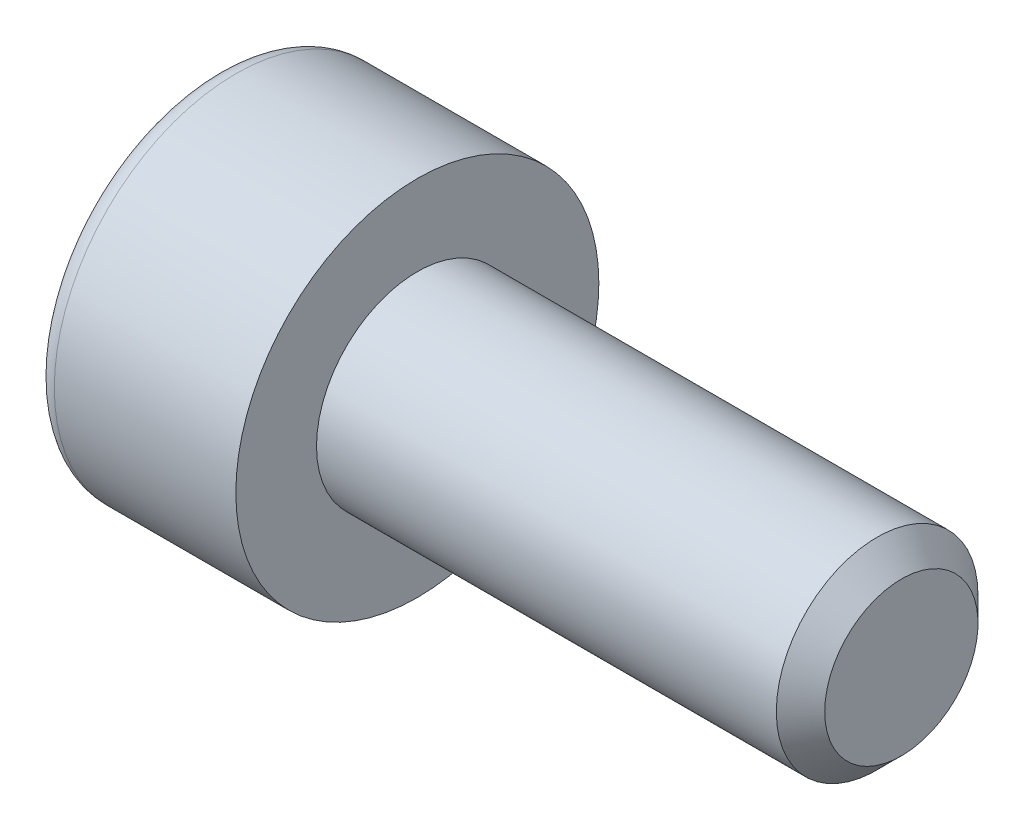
ISO-10303-21;
HEADER;
FILE_DESCRIPTION(('STEP AP214'),'2;1');
FILE_NAME('part.step','',(''),(''),'','','');
FILE_SCHEMA(('AUTOMOTIVE_DESIGN { 1 0 10303 214 1 1 1 1 }'));
ENDSEC;
DATA;
#1=APPLICATION_CONTEXT('core data for automotive mechanical design processes');
#2=APPLICATION_PROTOCOL_DEFINITION('international standard','automotive_design',2000,#1);
#3=PRODUCT_CONTEXT('',#1,'mechanical');
#4=PRODUCT('Part','Part','',(#3));
#5=PRODUCT_RELATED_PRODUCT_CATEGORY('part','',(#4));
#6=PRODUCT_DEFINITION_FORMATION('','',#4);
#7=PRODUCT_DEFINITION_CONTEXT('part definition',#1,'design');
#8=PRODUCT_DEFINITION('design','',#6,#7);
#9=PRODUCT_DEFINITION_SHAPE('','',#8);
#10=(LENGTH_UNIT() NAMED_UNIT(*) SI_UNIT(.MILLI.,.METRE.));
#11=(NAMED_UNIT(*) PLANE_ANGLE_UNIT() SI_UNIT($,.RADIAN.));
#12=(NAMED_UNIT(*) SI_UNIT($,.STERADIAN.) SOLID_ANGLE_UNIT());
#13=UNCERTAINTY_MEASURE_WITH_UNIT(LENGTH_MEASURE(1.E-05),#10,'distance_accuracy_value','');
#14=(GEOMETRIC_REPRESENTATION_CONTEXT(3) GLOBAL_UNCERTAINTY_ASSIGNED_CONTEXT((#13)) GLOBAL_UNIT_ASSIGNED_CONTEXT((#10,
#11,#12)) REPRESENTATION_CONTEXT('',''));
#15=CARTESIAN_POINT('',(0.,0.,0.));
#16=DIRECTION('',(0.,0.,1.));
#17=DIRECTION('',(1.,0.,0.));
#18=AXIS2_PLACEMENT_3D('',#15,#16,#17);
#19=CARTESIAN_POINT('',(-0.849999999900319,0.,0.));
#20=DIRECTION('',(-1.,0.,0.));
#21=DIRECTION('',(0.,-1.00000000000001,0.));
#22=AXIS2_PLACEMENT_3D('',#19,#20,#21);
#23=CONICAL_SURFACE('',#22,0.952380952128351,1.04719755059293);
#24=CARTESIAN_POINT('',(-0.300142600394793,-3.97903932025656E-10,0.));
#25=VERTEX_POINT('',#24);
#26=VERTEX_LOOP('',#25);
#27=FACE_BOUND('',#26,.T.);
#28=CARTESIAN_POINT('',(-0.850000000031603,0.,0.));
#29=DIRECTION('',(-1.,0.,0.));
#30=DIRECTION('',(0.,-1.00000000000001,0.));
#31=AXIS2_PLACEMENT_3D('',#28,#29,#30);
#32=CIRCLE('',#31,0.952380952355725);
#33=CARTESIAN_POINT('',(-0.850000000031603,-0.952380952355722,0.));
#34=VERTEX_POINT('',#33);
#35=EDGE_CURVE('E362',#34,#34,#32,.T.);
#36=ORIENTED_EDGE('',*,*,#35,.T.);
#37=EDGE_LOOP('',(#36));
#38=FACE_BOUND('',#37,.T.);
#39=ADVANCED_FACE('F17',(#27,#38),#23,.F.);
#40=CARTESIAN_POINT('',(-0.850000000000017,0.574463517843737,0.995000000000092));
#41=DIRECTION('',(0.,0.,1.00000000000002));
#42=DIRECTION('',(1.,0.,0.));
#43=AXIS2_PLACEMENT_3D('',#40,#41,#42);
#44=PLANE('',#43);
#45=DIRECTION('',(1.,0.,0.));
#46=VECTOR('',#45,1.);
#47=CARTESIAN_POINT('',(-0.850000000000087,-0.574463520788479,0.994999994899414));
#48=LINE('',#47,#46);
#49=CARTESIAN_POINT('',(-0.850000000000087,-0.57446352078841,0.994999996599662));
#50=VERTEX_POINT('',#49);
#51=CARTESIAN_POINT('',(-2.49892704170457,-0.574463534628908,0.994999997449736));
#52=VERTEX_POINT('',#51);
#53=EDGE_CURVE('E276',#50,#52,#48,.F.);
#54=ORIENTED_EDGE('',*,*,#53,.T.);
#55=CARTESIAN_POINT('',(-2.34499999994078,0.,0.995000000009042));
#56=CARTESIAN_POINT('',(-2.34497439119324,-0.0305677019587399,0.995000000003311));
#57=CARTESIAN_POINT('',(-2.34640800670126,-0.0611198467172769,0.995000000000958));
#58=CARTESIAN_POINT('',(-2.3519924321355,-0.121922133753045,0.994999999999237));
#59=CARTESIAN_POINT('',(-2.35613836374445,-0.152172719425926,0.994999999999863));
#60=CARTESIAN_POINT('',(-2.36686597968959,-0.21175945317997,0.995000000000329));
#61=CARTESIAN_POINT('',(-2.37340998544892,-0.241102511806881,0.99500000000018));
#62=CARTESIAN_POINT('',(-2.38864217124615,-0.299229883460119,0.995000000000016));
#63=CARTESIAN_POINT('',(-2.3973310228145,-0.328014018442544,0.995000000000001));
#64=CARTESIAN_POINT('',(-2.41947932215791,-0.393688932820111,0.995000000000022));
#65=CARTESIAN_POINT('',(-2.43358464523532,-0.430359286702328,0.995000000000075));
#66=CARTESIAN_POINT('',(-2.46443795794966,-0.503023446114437,0.995000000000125));
#67=CARTESIAN_POINT('',(-2.48121157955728,-0.53900644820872,0.99500000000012));
#68=CARTESIAN_POINT('',(-2.49892704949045,-0.574463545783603,0.995000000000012));
#69=B_SPLINE_CURVE_WITH_KNOTS('',3,(#55,#56,#57,#58,#59,#60,#61,#62,#63,#64,#65,#66,#67,#68),
.UNSPECIFIED.,.F.,.F.,(4,2,2,2,2,2,4),(0.,0.0916446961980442,0.1831250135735,0.273225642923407,
0.363354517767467,0.481117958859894,0.600089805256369),.UNSPECIFIED.);
#70=CARTESIAN_POINT('',(-2.34499999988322,0.,0.995000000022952));
#71=VERTEX_POINT('',#70);
#72=EDGE_CURVE('E95',#71,#52,#69,.T.);
#73=ORIENTED_EDGE('',*,*,#72,.F.);
#74=CARTESIAN_POINT('',(-2.4989270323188,0.574463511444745,0.995000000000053));
#75=CARTESIAN_POINT('',(-2.47907510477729,0.534722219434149,0.995000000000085));
#76=CARTESIAN_POINT('',(-2.4603959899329,0.494309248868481,0.995000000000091));
#77=CARTESIAN_POINT('',(-2.42621425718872,0.411872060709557,0.995000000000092));
#78=CARTESIAN_POINT('',(-2.41073261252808,0.36983922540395,0.995000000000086));
#79=CARTESIAN_POINT('',(-2.38444123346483,0.285641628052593,0.9950000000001));
#80=CARTESIAN_POINT('',(-2.37350879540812,0.243516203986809,0.995000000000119));
#81=CARTESIAN_POINT('',(-2.35666503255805,0.158361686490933,0.995000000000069));
#82=CARTESIAN_POINT('',(-2.35073836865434,0.115335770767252,0.995));
#83=CARTESIAN_POINT('',(-2.34674431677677,0.0601561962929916,0.995000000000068));
#84=CARTESIAN_POINT('',(-2.3460924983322,0.0481633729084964,0.995000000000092));
#85=CARTESIAN_POINT('',(-2.34521965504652,0.0241145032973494,0.995000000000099));
#86=CARTESIAN_POINT('',(-2.34500034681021,0.0120583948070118,0.995000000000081));
#87=CARTESIAN_POINT('',(-2.34499999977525,1.11022302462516E-13,0.995000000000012));
#88=B_SPLINE_CURVE_WITH_KNOTS('',3,(#74,#75,#76,#77,#78,#79,#80,#81,#82,#83,#84,#85,#86,#87),
.UNSPECIFIED.,.F.,.F.,(4,2,2,2,2,2,4),(0.,0.133369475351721,0.267587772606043,0.397905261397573,
0.527821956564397,0.563847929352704,0.600016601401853),.UNSPECIFIED.);
#89=CARTESIAN_POINT('',(-2.4989270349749,0.57446351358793,0.995000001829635));
#90=VERTEX_POINT('',#89);
#91=EDGE_CURVE('E89',#90,#71,#88,.T.);
#92=ORIENTED_EDGE('',*,*,#91,.F.);
#93=DIRECTION('',(1.,0.,0.));
#94=VECTOR('',#93,1.);
#95=CARTESIAN_POINT('',(-0.850000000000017,0.574463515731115,0.995000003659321));
#96=LINE('',#95,#94);
#97=CARTESIAN_POINT('',(-0.850000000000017,0.574463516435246,0.99500000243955));
#98=VERTEX_POINT('',#97);
#99=EDGE_CURVE('E93',#90,#98,#96,.T.);
#100=ORIENTED_EDGE('',*,*,#99,.T.);
#101=DIRECTION('',(0.,1.00000000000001,0.));
#102=VECTOR('',#101,1.);
#103=CARTESIAN_POINT('',(-0.850000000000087,0.,0.994999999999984));
#104=LINE('',#103,#102);
#105=EDGE_CURVE('E107',#98,#50,#104,.F.);
#106=ORIENTED_EDGE('',*,*,#105,.T.);
#107=EDGE_LOOP('',(#54,#73,#92,#100,#106));
#108=FACE_BOUND('',#107,.T.);
#109=ADVANCED_FACE('F92',(#108),#44,.F.);
#110=CARTESIAN_POINT('',(-0.850000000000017,0.,0.));
#111=DIRECTION('',(1.,0.,0.));
#112=DIRECTION('',(0.,0.,-1.00000000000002));
#113=AXIS2_PLACEMENT_3D('',#110,#111,#112);
#114=PLANE('',#113);
#115=DIRECTION('',(0.,1.00000000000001,0.));
#116=VECTOR('',#115,1.);
#117=CARTESIAN_POINT('',(-0.850000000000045,-0.574463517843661,-0.995000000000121));
#118=LINE('',#117,#116);
#119=CARTESIAN_POINT('',(-0.850000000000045,0.574463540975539,-0.994999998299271));
#120=VERTEX_POINT('',#119);
#121=CARTESIAN_POINT('',(-0.850000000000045,-0.574463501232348,-0.995000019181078));
#122=VERTEX_POINT('',#121);
#123=EDGE_CURVE('E266',#120,#122,#118,.F.);
#124=ORIENTED_EDGE('',*,*,#123,.T.);
#125=DIRECTION('',(0.,0.499999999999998,-0.866025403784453));
#126=VECTOR('',#125,1.);
#127=CARTESIAN_POINT('',(-0.850000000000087,-1.14892703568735,0.));
#128=LINE('',#127,#126);
#129=CARTESIAN_POINT('',(-0.850000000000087,-1.14892703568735,0.));
#130=VERTEX_POINT('',#129);
#131=EDGE_CURVE('E115',#122,#130,#128,.F.);
#132=ORIENTED_EDGE('',*,*,#131,.T.);
#133=DIRECTION('',(0.,-0.500000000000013,-0.866025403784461));
#134=VECTOR('',#133,1.);
#135=CARTESIAN_POINT('',(-0.850000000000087,-0.574463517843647,0.995000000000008));
#136=LINE('',#135,#134);
#137=EDGE_CURVE('E368',#130,#50,#136,.F.);
#138=ORIENTED_EDGE('',*,*,#137,.T.);
#139=ORIENTED_EDGE('',*,*,#105,.F.);
#140=DIRECTION('',(0.,-0.499999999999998,0.866025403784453));
#141=VECTOR('',#140,1.);
#142=CARTESIAN_POINT('',(-0.850000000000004,1.14892703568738,0.));
#143=LINE('',#142,#141);
#144=CARTESIAN_POINT('',(-0.850000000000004,1.14892703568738,0.));
#145=VERTEX_POINT('',#144);
#146=EDGE_CURVE('E106',#98,#145,#143,.F.);
#147=ORIENTED_EDGE('',*,*,#146,.T.);
#148=DIRECTION('',(0.,0.500000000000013,0.866025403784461));
#149=VECTOR('',#148,1.);
#150=CARTESIAN_POINT('',(-0.850000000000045,0.574463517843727,-0.995000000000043));
#151=LINE('',#150,#149);
#152=EDGE_CURVE('E268',#145,#120,#151,.F.);
#153=ORIENTED_EDGE('',*,*,#152,.T.);
#154=EDGE_LOOP('',(#124,#132,#138,#139,#147,#153));
#155=FACE_BOUND('',#154,.T.);
#156=ORIENTED_EDGE('',*,*,#35,.F.);
#157=EDGE_LOOP('',(#156));
#158=FACE_BOUND('',#157,.T.);
#159=ADVANCED_FACE('F165',(#155,#158),#114,.F.);
#160=CARTESIAN_POINT('',(-0.850000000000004,1.14892703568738,0.));
#161=DIRECTION('',(0.,0.866025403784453,0.500000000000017));
#162=DIRECTION('',(0.,-0.499999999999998,0.866025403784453));
#163=AXIS2_PLACEMENT_3D('',#160,#161,#162);
#164=PLANE('',#163);
#165=ORIENTED_EDGE('',*,*,#99,.F.);
#166=CARTESIAN_POINT('',(-2.49892703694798,0.574463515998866,0.995000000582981));
#167=CARTESIAN_POINT('',(-2.47920127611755,0.594208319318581,0.960800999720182));
#168=CARTESIAN_POINT('',(-2.46063414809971,0.614283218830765,0.926030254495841));
#169=CARTESIAN_POINT('',(-2.42663856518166,0.655218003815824,0.855129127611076));
#170=CARTESIAN_POINT('',(-2.41122901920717,0.676081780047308,0.818992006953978));
#171=CARTESIAN_POINT('',(-2.3848328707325,0.718152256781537,0.746123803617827));
#172=CARTESIAN_POINT('',(-2.37377985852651,0.739348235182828,0.709411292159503));
#173=CARTESIAN_POINT('',(-2.35674986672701,0.782206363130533,0.635178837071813));
#174=CARTESIAN_POINT('',(-2.35076018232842,0.803867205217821,0.59766115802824));
#175=CARTESIAN_POINT('',(-2.34535763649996,0.841202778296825,0.532994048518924));
#176=CARTESIAN_POINT('',(-2.34455932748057,0.856829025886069,0.50592859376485));
#177=CARTESIAN_POINT('',(-2.34590474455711,0.888051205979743,0.451850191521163));
#178=CARTESIAN_POINT('',(-2.34804912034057,0.903647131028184,0.424837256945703));
#179=CARTESIAN_POINT('',(-2.35875462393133,0.950212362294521,0.344183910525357));
#180=CARTESIAN_POINT('',(-2.37158937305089,0.980949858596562,0.290945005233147));
#181=CARTESIAN_POINT('',(-2.40257138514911,1.03491361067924,0.197477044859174));
#182=CARTESIAN_POINT('',(-2.41909924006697,1.0583922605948,0.15681083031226));
#183=CARTESIAN_POINT('',(-2.45633127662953,1.10442922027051,0.0770724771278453));
#184=CARTESIAN_POINT('',(-2.47702183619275,1.12699025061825,0.0379956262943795));
#185=CARTESIAN_POINT('',(-2.49914390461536,1.14914384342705,-0.000375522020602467));
#186=B_SPLINE_CURVE_WITH_KNOTS('',3,(#166,#167,#168,#169,#170,#171,#172,#173,#174,#175,#176,
#177,#178,#179,#180,#181,#182,#183,#184,#185),.UNSPECIFIED.,.F.,.F.,(4,2,2,2,2,2,2,2,2,4),(0.,
0.132518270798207,0.265808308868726,0.396979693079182,0.527820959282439,0.621473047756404,
0.715145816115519,0.902546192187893,1.05168981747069,1.20035309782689),.UNSPECIFIED.);
#187=CARTESIAN_POINT('',(-2.49966772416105,1.14925824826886,-7.03980238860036E-06));
#188=VERTEX_POINT('',#187);
#189=EDGE_CURVE('E104',#90,#188,#186,.T.);
#190=ORIENTED_EDGE('',*,*,#189,.T.);
#191=DIRECTION('',(1.,0.,0.));
#192=VECTOR('',#191,1.);
#193=CARTESIAN_POINT('',(-0.850000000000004,1.14892703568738,0.));
#194=LINE('',#193,#192);
#195=EDGE_CURVE('E367',#188,#145,#194,.T.);
#196=ORIENTED_EDGE('',*,*,#195,.T.);
#197=ORIENTED_EDGE('',*,*,#146,.F.);
#198=EDGE_LOOP('',(#165,#190,#196,#197));
#199=FACE_BOUND('',#198,.T.);
#200=ADVANCED_FACE('F102',(#199),#164,.F.);
#201=CARTESIAN_POINT('',(-0.850000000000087,-0.574463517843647,0.995000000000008));
#202=DIRECTION('',(0.,-0.866025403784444,0.500000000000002));
#203=DIRECTION('',(0.,-0.500000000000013,-0.866025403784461));
#204=AXIS2_PLACEMENT_3D('',#201,#202,#203);
#205=PLANE('',#204);
#206=DIRECTION('',(-1.,0.,0.));
#207=VECTOR('',#206,1.);
#208=CARTESIAN_POINT('',(-0.850000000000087,-1.14892703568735,0.));
#209=LINE('',#208,#207);
#210=CARTESIAN_POINT('',(-2.49966773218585,-1.14925825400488,-7.06998226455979E-06));
#211=VERTEX_POINT('',#210);
#212=EDGE_CURVE('E138',#130,#211,#209,.T.);
#213=ORIENTED_EDGE('',*,*,#212,.T.);
#214=CARTESIAN_POINT('',(-2.49914391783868,-1.14914385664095,-0.000375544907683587));
#215=CARTESIAN_POINT('',(-2.47939437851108,-1.12938634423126,0.0338454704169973));
#216=CARTESIAN_POINT('',(-2.46080382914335,-1.10929839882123,0.0686388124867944));
#217=CARTESIAN_POINT('',(-2.42676345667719,-1.06833625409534,0.139587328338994));
#218=CARTESIAN_POINT('',(-2.4113325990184,-1.04745814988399,0.175749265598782));
#219=CARTESIAN_POINT('',(-2.38489828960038,-1.00535786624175,0.248669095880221));
#220=CARTESIAN_POINT('',(-2.37382839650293,-0.984146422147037,0.28540839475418));
#221=CARTESIAN_POINT('',(-2.35677144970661,-0.941256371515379,0.359696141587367));
#222=CARTESIAN_POINT('',(-2.35077164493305,-0.919579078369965,0.397242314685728));
#223=CARTESIAN_POINT('',(-2.34536074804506,-0.88222607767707,0.461939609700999));
#224=CARTESIAN_POINT('',(-2.3445600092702,-0.866599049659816,0.489006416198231));
#225=CARTESIAN_POINT('',(-2.34590089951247,-0.835375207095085,0.543087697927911));
#226=CARTESIAN_POINT('',(-2.34804317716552,-0.819778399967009,0.570102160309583));
#227=CARTESIAN_POINT('',(-2.35874295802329,-0.773210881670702,0.650759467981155));
#228=CARTESIAN_POINT('',(-2.37157459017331,-0.74247185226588,0.704001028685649));
#229=CARTESIAN_POINT('',(-2.40253243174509,-0.688540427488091,0.797412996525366));
#230=CARTESIAN_POINT('',(-2.4190307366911,-0.665094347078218,0.838022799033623));
#231=CARTESIAN_POINT('',(-2.45619424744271,-0.619119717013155,0.917653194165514));
#232=CARTESIAN_POINT('',(-2.47684592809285,-0.596588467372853,0.956678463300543));
#233=CARTESIAN_POINT('',(-2.49892698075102,-0.574463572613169,0.994999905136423));
#234=B_SPLINE_CURVE_WITH_KNOTS('',3,(#214,#215,#216,#217,#218,#219,#220,#221,#222,#223,#224,
#225,#226,#227,#228,#229,#230,#231,#232,#233),.UNSPECIFIED.,.F.,.F.,(4,2,2,2,2,2,2,2,2,4),(0.,
0.132618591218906,0.266011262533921,0.397284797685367,0.528227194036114,0.621884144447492,
0.715561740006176,0.902968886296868,1.05189958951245,1.20035294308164),.UNSPECIFIED.);
#235=EDGE_CURVE('E117',#211,#52,#234,.T.);
#236=ORIENTED_EDGE('',*,*,#235,.T.);
#237=ORIENTED_EDGE('',*,*,#53,.F.);
#238=ORIENTED_EDGE('',*,*,#137,.F.);
#239=EDGE_LOOP('',(#213,#236,#237,#238));
#240=FACE_BOUND('',#239,.T.);
#241=ADVANCED_FACE('F174',(#240),#205,.F.);
#242=CARTESIAN_POINT('',(-0.850000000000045,0.574463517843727,-0.995000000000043));
#243=DIRECTION('',(0.,0.866025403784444,-0.500000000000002));
#244=DIRECTION('',(0.,0.500000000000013,0.866025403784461));
#245=AXIS2_PLACEMENT_3D('',#242,#243,#244);
#246=PLANE('',#245);
#247=ORIENTED_EDGE('',*,*,#195,.F.);
#248=CARTESIAN_POINT('',(-2.49913902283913,1.1491389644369,0.000367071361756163));
#249=CARTESIAN_POINT('',(-2.47939002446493,1.12938174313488,-0.0338534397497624));
#250=CARTESIAN_POINT('',(-2.46080000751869,1.10929409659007,-0.0686462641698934));
#251=CARTESIAN_POINT('',(-2.42676065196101,1.0683325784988,-0.139593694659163));
#252=CARTESIAN_POINT('',(-2.41133027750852,1.04745480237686,-0.1757550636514));
#253=CARTESIAN_POINT('',(-2.38489682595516,1.00535519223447,-0.24867372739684));
#254=CARTESIAN_POINT('',(-2.37382730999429,0.984144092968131,-0.285412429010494));
#255=CARTESIAN_POINT('',(-2.35677096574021,0.941254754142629,-0.359698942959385));
#256=CARTESIAN_POINT('',(-2.35077138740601,0.919577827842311,-0.397244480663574));
#257=CARTESIAN_POINT('',(-2.34536067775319,0.882225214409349,-0.461941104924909));
#258=CARTESIAN_POINT('',(-2.34455999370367,0.866598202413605,-0.489007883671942));
#259=CARTESIAN_POINT('',(-2.3459009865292,0.835374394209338,-0.543089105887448));
#260=CARTESIAN_POINT('',(-2.3480433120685,0.819777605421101,-0.570103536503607));
#261=CARTESIAN_POINT('',(-2.35874322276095,0.773210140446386,-0.650760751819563));
#262=CARTESIAN_POINT('',(-2.37157492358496,0.742471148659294,-0.704002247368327));
#263=CARTESIAN_POINT('',(-2.4025328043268,0.688539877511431,-0.79741394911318));
#264=CARTESIAN_POINT('',(-2.41903106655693,0.665093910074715,-0.838023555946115));
#265=CARTESIAN_POINT('',(-2.45619444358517,0.619119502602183,-0.917653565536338));
#266=CARTESIAN_POINT('',(-2.47684603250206,0.596588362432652,-0.95667864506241));
#267=CARTESIAN_POINT('',(-2.49892698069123,0.57446357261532,-0.994999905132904));
#268=B_SPLINE_CURVE_WITH_KNOTS('',3,(#248,#249,#250,#251,#252,#253,#254,#255,#256,#257,#258,
#259,#260,#261,#262,#263,#264,#265,#266,#267),.UNSPECIFIED.,.F.,.F.,(4,2,2,2,2,2,2,2,2,4),(0.,
0.132616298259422,0.266006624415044,0.397277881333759,0.528218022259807,0.62187487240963,
0.715552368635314,0.902959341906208,1.05188936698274,1.20034201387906),.UNSPECIFIED.);
#269=CARTESIAN_POINT('',(-2.49892701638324,0.574463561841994,-0.994999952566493));
#270=VERTEX_POINT('',#269);
#271=EDGE_CURVE('E244',#188,#270,#268,.T.);
#272=ORIENTED_EDGE('',*,*,#271,.T.);
#273=DIRECTION('',(-1.,0.,0.));
#274=VECTOR('',#273,1.);
#275=CARTESIAN_POINT('',(-0.850000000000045,0.574463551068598,-0.995000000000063));
#276=LINE('',#275,#274);
#277=EDGE_CURVE('E262',#270,#120,#276,.F.);
#278=ORIENTED_EDGE('',*,*,#277,.T.);
#279=ORIENTED_EDGE('',*,*,#152,.F.);
#280=EDGE_LOOP('',(#247,#272,#278,#279));
#281=FACE_BOUND('',#280,.T.);
#282=ADVANCED_FACE('F245',(#281),#246,.F.);
#283=CARTESIAN_POINT('',(-0.850000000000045,-0.574463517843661,-0.995000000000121));
#284=DIRECTION('',(0.,0.,-1.00000000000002));
#285=DIRECTION('',(-1.,0.,0.));
#286=AXIS2_PLACEMENT_3D('',#283,#284,#285);
#287=PLANE('',#286);
#288=ORIENTED_EDGE('',*,*,#277,.F.);
#289=CARTESIAN_POINT('',(-2.49892706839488,0.574463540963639,-0.994999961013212));
#290=CARTESIAN_POINT('',(-2.47920147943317,0.53497430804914,-0.994999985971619));
#291=CARTESIAN_POINT('',(-2.46063450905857,0.494824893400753,-0.994999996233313));
#292=CARTESIAN_POINT('',(-2.42663917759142,0.412956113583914,-0.995000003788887));
#293=CARTESIAN_POINT('',(-2.4112297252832,0.371228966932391,-0.995000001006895));
#294=CARTESIAN_POINT('',(-2.38483341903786,0.287088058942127,-0.994999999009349));
#295=CARTESIAN_POINT('',(-2.37378023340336,0.244695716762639,-0.994999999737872));
#296=CARTESIAN_POINT('',(-2.35674998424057,0.158978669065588,-0.995000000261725));
#297=CARTESIAN_POINT('',(-2.35076021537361,0.115656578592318,-0.995000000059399));
#298=CARTESIAN_POINT('',(-2.34535762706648,0.0409848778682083,-0.99499999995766));
#299=CARTESIAN_POINT('',(-2.34455931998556,0.00973223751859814,-0.994999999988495));
#300=CARTESIAN_POINT('',(-2.34590477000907,-0.0527124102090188,-0.995000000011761));
#301=CARTESIAN_POINT('',(-2.34804917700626,-0.0839044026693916,-0.995000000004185));
#302=CARTESIAN_POINT('',(-2.35875473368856,-0.177034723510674,-0.994999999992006));
#303=CARTESIAN_POINT('',(-2.37158942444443,-0.238509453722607,-0.994999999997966));
#304=CARTESIAN_POINT('',(-2.4025490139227,-0.346358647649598,-0.995000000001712));
#305=CARTESIAN_POINT('',(-2.41904541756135,-0.39324075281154,-0.995000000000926));
#306=CARTESIAN_POINT('',(-2.45620297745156,-0.485170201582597,-0.994999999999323));
#307=CARTESIAN_POINT('',(-2.47685057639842,-0.530222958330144,-0.994999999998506));
#308=CARTESIAN_POINT('',(-2.49892698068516,-0.574463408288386,-0.995000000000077));
#309=B_SPLINE_CURVE_WITH_KNOTS('',3,(#289,#290,#291,#292,#293,#294,#295,#296,#297,#298,#299,
#300,#301,#302,#303,#304,#305,#306,#307,#308),.UNSPECIFIED.,.F.,.F.,(4,2,2,2,2,2,2,2,2,4),(0.,
0.132517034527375,0.265805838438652,0.396978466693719,0.527820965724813,0.621473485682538,
0.715146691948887,0.902546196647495,1.05144671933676,1.19986862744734),.UNSPECIFIED.);
#310=CARTESIAN_POINT('',(-2.4989270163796,-0.574463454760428,-0.995000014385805));
#311=VERTEX_POINT('',#310);
#312=EDGE_CURVE('E219',#270,#311,#309,.T.);
#313=ORIENTED_EDGE('',*,*,#312,.T.);
#314=DIRECTION('',(1.,0.,0.));
#315=VECTOR('',#314,1.);
#316=CARTESIAN_POINT('',(-0.850000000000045,-0.574463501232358,-0.995000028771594));
#317=LINE('',#316,#315);
#318=EDGE_CURVE('E120',#311,#122,#317,.T.);
#319=ORIENTED_EDGE('',*,*,#318,.T.);
#320=ORIENTED_EDGE('',*,*,#123,.F.);
#321=EDGE_LOOP('',(#288,#313,#319,#320));
#322=FACE_BOUND('',#321,.T.);
#323=ADVANCED_FACE('F248',(#322),#287,.F.);
#324=CARTESIAN_POINT('',(-0.850000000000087,-1.14892703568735,0.));
#325=DIRECTION('',(0.,-0.866025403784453,-0.500000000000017));
#326=DIRECTION('',(0.,0.499999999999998,-0.866025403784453));
#327=AXIS2_PLACEMENT_3D('',#324,#325,#326);
#328=PLANE('',#327);
#329=ORIENTED_EDGE('',*,*,#318,.F.);
#330=CARTESIAN_POINT('',(-2.49892706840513,-0.574463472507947,-0.995000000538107));
#331=CARTESIAN_POINT('',(-2.47920129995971,-0.594208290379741,-0.960801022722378));
#332=CARTESIAN_POINT('',(-2.46063417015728,-0.614283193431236,-0.926030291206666));
#333=CARTESIAN_POINT('',(-2.42663858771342,-0.655217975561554,-0.855129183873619));
#334=CARTESIAN_POINT('',(-2.41122904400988,-0.676081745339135,-0.818992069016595));
#335=CARTESIAN_POINT('',(-2.38483289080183,-0.718152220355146,-0.746123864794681));
#336=CARTESIAN_POINT('',(-2.37377987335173,-0.739348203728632,-0.70941134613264));
#337=CARTESIAN_POINT('',(-2.35674987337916,-0.782206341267,-0.635178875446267));
#338=CARTESIAN_POINT('',(-2.35076018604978,-0.803867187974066,-0.597661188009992));
#339=CARTESIAN_POINT('',(-2.34535763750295,-0.841202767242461,-0.532994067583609));
#340=CARTESIAN_POINT('',(-2.34455932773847,-0.856829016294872,-0.505928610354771));
#341=CARTESIAN_POINT('',(-2.34590474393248,-0.888051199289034,-0.451850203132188));
#342=CARTESIAN_POINT('',(-2.34804911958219,-0.903647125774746,-0.424837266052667));
#343=CARTESIAN_POINT('',(-2.35875462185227,-0.950212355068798,-0.344183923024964));
#344=CARTESIAN_POINT('',(-2.37158936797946,-0.98094984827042,-0.290945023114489));
#345=CARTESIAN_POINT('',(-2.40257087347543,-1.03491272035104,-0.197478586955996));
#346=CARTESIAN_POINT('',(-2.41909802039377,-1.05839052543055,-0.156813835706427));
#347=CARTESIAN_POINT('',(-2.45632838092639,-1.10442586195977,-0.0770782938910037));
#348=CARTESIAN_POINT('',(-2.47701797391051,-1.12698611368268,-0.0380027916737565));
#349=CARTESIAN_POINT('',(-2.49913901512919,-1.1491389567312,0.00036705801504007));
#350=B_SPLINE_CURVE_WITH_KNOTS('',3,(#330,#331,#332,#333,#334,#335,#336,#337,#338,#339,#340,
#341,#342,#343,#344,#345,#346,#347,#348,#349),.UNSPECIFIED.,.F.,.F.,(4,2,2,2,2,2,2,2,2,4),(0.,
0.13251824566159,0.265808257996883,0.396979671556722,0.527820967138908,0.621473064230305,
0.715145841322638,0.902546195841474,1.05168435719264,1.20034221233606),.UNSPECIFIED.);
#351=EDGE_CURVE('E214',#311,#211,#350,.T.);
#352=ORIENTED_EDGE('',*,*,#351,.T.);
#353=ORIENTED_EDGE('',*,*,#212,.F.);
#354=ORIENTED_EDGE('',*,*,#131,.F.);
#355=EDGE_LOOP('',(#329,#352,#353,#354));
#356=FACE_BOUND('',#355,.T.);
#357=ADVANCED_FACE('F146',(#356),#328,.F.);
#358=CARTESIAN_POINT('',(-2.50093169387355,0.,0.));
#359=DIRECTION('',(-1.,0.,0.));
#360=DIRECTION('',(0.,0.,1.00000000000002));
#361=AXIS2_PLACEMENT_3D('',#358,#359,#360);
#362=CONICAL_SURFACE('',#361,1.1509316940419,0.785398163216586);
#363=CARTESIAN_POINT('',(-2.5,0.,0.));
#364=DIRECTION('',(-1.,0.,0.));
#365=DIRECTION('',(0.,0.,1.00000000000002));
#366=AXIS2_PLACEMENT_3D('',#363,#364,#365);
#367=CIRCLE('',#366,1.15000000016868);
#368=CARTESIAN_POINT('',(-2.4999999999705,0.,1.15000000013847));
#369=VERTEX_POINT('',#368);
#370=EDGE_CURVE('E112',#188,#369,#367,.F.);
#371=ORIENTED_EDGE('',*,*,#370,.F.);
#372=ORIENTED_EDGE('',*,*,#189,.F.);
#373=ORIENTED_EDGE('',*,*,#91,.T.);
#374=DIRECTION('',(0.707106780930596,0.,-0.707106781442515));
#375=VECTOR('',#374,1.);
#376=CARTESIAN_POINT('',(-499000.000000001,4.49364156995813E-09,498998.650361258));
#377=LINE('',#376,#375);
#378=EDGE_CURVE('E114',#71,#369,#377,.F.);
#379=ORIENTED_EDGE('',*,*,#378,.T.);
#380=EDGE_LOOP('',(#371,#372,#373,#379));
#381=FACE_BOUND('',#380,.T.);
#382=ADVANCED_FACE('F110',(#381),#362,.F.);
#383=CARTESIAN_POINT('',(-2.50093106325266,0.,0.));
#384=DIRECTION('',(-1.,0.,0.));
#385=DIRECTION('',(0.,0.,1.00000000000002));
#386=AXIS2_PLACEMENT_3D('',#383,#384,#385);
#387=CONICAL_SURFACE('',#386,1.15093106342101,0.785398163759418);
#388=ORIENTED_EDGE('',*,*,#235,.F.);
#389=CARTESIAN_POINT('',(-2.5,0.,0.));
#390=DIRECTION('',(-1.,0.,0.));
#391=DIRECTION('',(0.,0.,1.00000000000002));
#392=AXIS2_PLACEMENT_3D('',#389,#390,#391);
#393=CIRCLE('',#392,1.15000000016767);
#394=EDGE_CURVE('E206',#369,#211,#393,.F.);
#395=ORIENTED_EDGE('',*,*,#394,.F.);
#396=ORIENTED_EDGE('',*,*,#378,.F.);
#397=ORIENTED_EDGE('',*,*,#72,.T.);
#398=EDGE_LOOP('',(#388,#395,#396,#397));
#399=FACE_BOUND('',#398,.T.);
#400=ADVANCED_FACE('F145',(#399),#387,.F.);
#401=CARTESIAN_POINT('',(-2.49946090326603,0.,0.));
#402=DIRECTION('',(-1.,0.,0.));
#403=DIRECTION('',(0.,0.,1.00000000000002));
#404=AXIS2_PLACEMENT_3D('',#401,#402,#403);
#405=CONICAL_SURFACE('',#404,1.14946090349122,0.785398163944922);
#406=ORIENTED_EDGE('',*,*,#312,.F.);
#407=ORIENTED_EDGE('',*,*,#271,.F.);
#408=CARTESIAN_POINT('',(-2.5,0.,0.));
#409=DIRECTION('',(-1.,0.,0.));
#410=DIRECTION('',(0.,0.,1.00000000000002));
#411=AXIS2_PLACEMENT_3D('',#408,#409,#410);
#412=CIRCLE('',#411,1.15000000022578);
#413=EDGE_CURVE('E202',#211,#188,#412,.F.);
#414=ORIENTED_EDGE('',*,*,#413,.F.);
#415=ORIENTED_EDGE('',*,*,#351,.F.);
#416=EDGE_LOOP('',(#406,#407,#414,#415));
#417=FACE_BOUND('',#416,.T.);
#418=ADVANCED_FACE('F229',(#417),#405,.F.);
#419=CARTESIAN_POINT('',(-2.5,1.57500000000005,0.));
#420=DIRECTION('',(-1.,0.,0.));
#421=DIRECTION('',(0.,0.,1.00000000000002));
#422=AXIS2_PLACEMENT_3D('',#419,#420,#421);
#423=PLANE('',#422);
#424=CARTESIAN_POINT('',(-2.50000000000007,0.,0.));
#425=DIRECTION('',(1.,0.,0.));
#426=DIRECTION('',(0.,0.,-1.));
#427=AXIS2_PLACEMENT_3D('',#424,#425,#426);
#428=CIRCLE('',#427,2.00000000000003);
#429=CARTESIAN_POINT('',(-2.5,0.,-1.99999999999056));
#430=VERTEX_POINT('',#429);
#431=CARTESIAN_POINT('',(-2.5,2.00000000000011,0.));
#432=VERTEX_POINT('',#431);
#433=EDGE_CURVE('E205',#430,#432,#428,.T.);
#434=ORIENTED_EDGE('',*,*,#433,.F.);
#435=CARTESIAN_POINT('',(-2.50000000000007,0.,0.));
#436=DIRECTION('',(1.,0.,0.));
#437=DIRECTION('',(0.,0.,1.));
#438=AXIS2_PLACEMENT_3D('',#435,#436,#437);
#439=CIRCLE('',#438,1.99999999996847);
#440=CARTESIAN_POINT('',(-2.50000000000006,-3.94345181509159E-08,1.99999999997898));
#441=VERTEX_POINT('',#440);
#442=EDGE_CURVE('E291',#441,#430,#439,.T.);
#443=ORIENTED_EDGE('',*,*,#442,.F.);
#444=CARTESIAN_POINT('',(-2.50000000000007,0.,0.));
#445=DIRECTION('',(1.,0.,0.));
#446=DIRECTION('',(0.,1.,0.));
#447=AXIS2_PLACEMENT_3D('',#444,#445,#446);
#448=CIRCLE('',#447,2.00000000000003);
#449=EDGE_CURVE('E38',#432,#441,#448,.T.);
#450=ORIENTED_EDGE('',*,*,#449,.F.);
#451=EDGE_LOOP('',(#434,#443,#450));
#452=FACE_BOUND('',#451,.T.);
#453=ORIENTED_EDGE('',*,*,#394,.T.);
#454=ORIENTED_EDGE('',*,*,#413,.T.);
#455=ORIENTED_EDGE('',*,*,#370,.T.);
#456=EDGE_LOOP('',(#453,#454,#455));
#457=FACE_BOUND('',#456,.T.);
#458=ADVANCED_FACE('F233',(#452,#457),#423,.T.);
#459=CARTESIAN_POINT('',(-2.25000000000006,0.,0.));
#460=DIRECTION('',(-1.,0.,0.));
#461=DIRECTION('',(0.,0.,1.));
#462=AXIS2_PLACEMENT_3D('',#459,#460,#461);
#463=TOROIDAL_SURFACE('',#462,2.00000000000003,0.250000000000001);
#464=CARTESIAN_POINT('',(-2.25,0.,0.));
#465=DIRECTION('',(1.,0.,0.));
#466=DIRECTION('',(0.,0.,-1.00000000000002));
#467=AXIS2_PLACEMENT_3D('',#464,#465,#466);
#468=CIRCLE('',#467,2.25);
#469=CARTESIAN_POINT('',(-2.25,0.,-2.25000000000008));
#470=VERTEX_POINT('',#469);
#471=EDGE_CURVE('E198',#470,#470,#468,.T.);
#472=ORIENTED_EDGE('',*,*,#471,.F.);
#473=EDGE_LOOP('',(#472));
#474=FACE_BOUND('',#473,.T.);
#475=ORIENTED_EDGE('',*,*,#442,.T.);
#476=ORIENTED_EDGE('',*,*,#433,.T.);
#477=ORIENTED_EDGE('',*,*,#449,.T.);
#478=EDGE_LOOP('',(#475,#476,#477));
#479=FACE_BOUND('',#478,.T.);
#480=ADVANCED_FACE('F282',(#474,#479),#463,.T.);
#481=CARTESIAN_POINT('',(-1.12500000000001,0.,0.));
#482=DIRECTION('',(1.,0.,0.));
#483=DIRECTION('',(0.,0.,-1.00000000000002));
#484=AXIS2_PLACEMENT_3D('',#481,#482,#483);
#485=CYLINDRICAL_SURFACE('',#484,2.25);
#486=ORIENTED_EDGE('',*,*,#471,.T.);
#487=EDGE_LOOP('',(#486));
#488=FACE_BOUND('',#487,.T.);
#489=CARTESIAN_POINT('',(0.,0.,0.));
#490=DIRECTION('',(1.,0.,0.));
#491=DIRECTION('',(0.,0.,-1.00000000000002));
#492=AXIS2_PLACEMENT_3D('',#489,#490,#491);
#493=CIRCLE('',#492,2.25);
#494=CARTESIAN_POINT('',(0.,0.,-2.25000000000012));
#495=VERTEX_POINT('',#494);
#496=EDGE_CURVE('E194',#495,#495,#493,.T.);
#497=ORIENTED_EDGE('',*,*,#496,.F.);
#498=EDGE_LOOP('',(#497));
#499=FACE_BOUND('',#498,.T.);
#500=ADVANCED_FACE('F288',(#488,#499),#485,.T.);
#501=CARTESIAN_POINT('',(5.99999999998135,1.57260603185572,-7.00000000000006));
#502=DIRECTION('',(-1.,0.,0.));
#503=DIRECTION('',(0.,0.,1.00000000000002));
#504=AXIS2_PLACEMENT_3D('',#501,#502,#503);
#505=PLANE('',#504);
#506=CARTESIAN_POINT('',(5.99999999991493,0.,0.));
#507=DIRECTION('',(-1.,0.,0.));
#508=DIRECTION('',(0.,0.,1.00000000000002));
#509=AXIS2_PLACEMENT_3D('',#506,#507,#508);
#510=CIRCLE('',#509,0.949999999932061);
#511=CARTESIAN_POINT('',(5.99999999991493,0.,0.949999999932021));
#512=VERTEX_POINT('',#511);
#513=EDGE_CURVE('E192',#512,#512,#510,.T.);
#514=ORIENTED_EDGE('',*,*,#513,.F.);
#515=EDGE_LOOP('',(#514));
#516=FACE_BOUND('',#515,.T.);
#517=ADVANCED_FACE('F324',(#516),#505,.F.);
#518=CARTESIAN_POINT('',(0.,1.90000000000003,0.));
#519=DIRECTION('',(1.,0.,0.));
#520=DIRECTION('',(0.,0.,-1.00000000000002));
#521=AXIS2_PLACEMENT_3D('',#518,#519,#520);
#522=PLANE('',#521);
#523=CARTESIAN_POINT('',(0.,0.,0.));
#524=DIRECTION('',(1.,0.,0.));
#525=DIRECTION('',(0.,0.,-1.00000000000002));
#526=AXIS2_PLACEMENT_3D('',#523,#524,#525);
#527=CIRCLE('',#526,1.25);
#528=CARTESIAN_POINT('',(0.,0.,-1.2500000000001));
#529=VERTEX_POINT('',#528);
#530=EDGE_CURVE('E29',#529,#529,#527,.T.);
#531=ORIENTED_EDGE('',*,*,#530,.F.);
#532=EDGE_LOOP('',(#531));
#533=FACE_BOUND('',#532,.T.);
#534=ORIENTED_EDGE('',*,*,#496,.T.);
#535=EDGE_LOOP('',(#534));
#536=FACE_BOUND('',#535,.T.);
#537=ADVANCED_FACE('F183',(#533,#536),#522,.T.);
#538=CARTESIAN_POINT('',(5.69999999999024,0.,0.));
#539=DIRECTION('',(-1.,0.,0.));
#540=DIRECTION('',(0.,0.,1.00000000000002));
#541=AXIS2_PLACEMENT_3D('',#538,#539,#540);
#542=CONICAL_SURFACE('',#541,1.2499999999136,0.785398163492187);
#543=CARTESIAN_POINT('',(5.69999999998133,0.,0.));
#544=DIRECTION('',(1.,0.,0.));
#545=DIRECTION('',(0.,0.,-1.00000000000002));
#546=AXIS2_PLACEMENT_3D('',#543,#544,#545);
#547=CIRCLE('',#546,1.25);
#548=CARTESIAN_POINT('',(5.69999999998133,0.,-1.25000000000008));
#549=VERTEX_POINT('',#548);
#550=EDGE_CURVE('E11',#549,#549,#547,.F.);
#551=ORIENTED_EDGE('',*,*,#550,.F.);
#552=EDGE_LOOP('',(#551));
#553=FACE_BOUND('',#552,.T.);
#554=ORIENTED_EDGE('',*,*,#513,.T.);
#555=EDGE_LOOP('',(#554));
#556=FACE_BOUND('',#555,.T.);
#557=ADVANCED_FACE('F177',(#553,#556),#542,.T.);
#558=CARTESIAN_POINT('',(4.11699999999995,0.,0.));
#559=DIRECTION('',(1.,0.,0.));
#560=DIRECTION('',(0.,0.,-1.00000000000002));
#561=AXIS2_PLACEMENT_3D('',#558,#559,#560);
#562=CYLINDRICAL_SURFACE('',#561,1.25);
#563=ORIENTED_EDGE('',*,*,#530,.T.);
#564=EDGE_LOOP('',(#563));
#565=FACE_BOUND('',#564,.T.);
#566=ORIENTED_EDGE('',*,*,#550,.T.);
#567=EDGE_LOOP('',(#566));
#568=FACE_BOUND('',#567,.T.);
#569=ADVANCED_FACE('F19',(#565,#568),#562,.T.);
#570=CLOSED_SHELL('',(#39,#109,#159,#200,#241,#282,#323,#357,#382,#400,#418,#458,#480,#500,#517,
#537,#557,#569));
#571=MANIFOLD_SOLID_BREP('B1',#570);
#572=ADVANCED_BREP_SHAPE_REPRESENTATION('',(#18,#571),#14);
#573=SHAPE_DEFINITION_REPRESENTATION(#9,#572);
ENDSEC;
END-ISO-10303-21;
